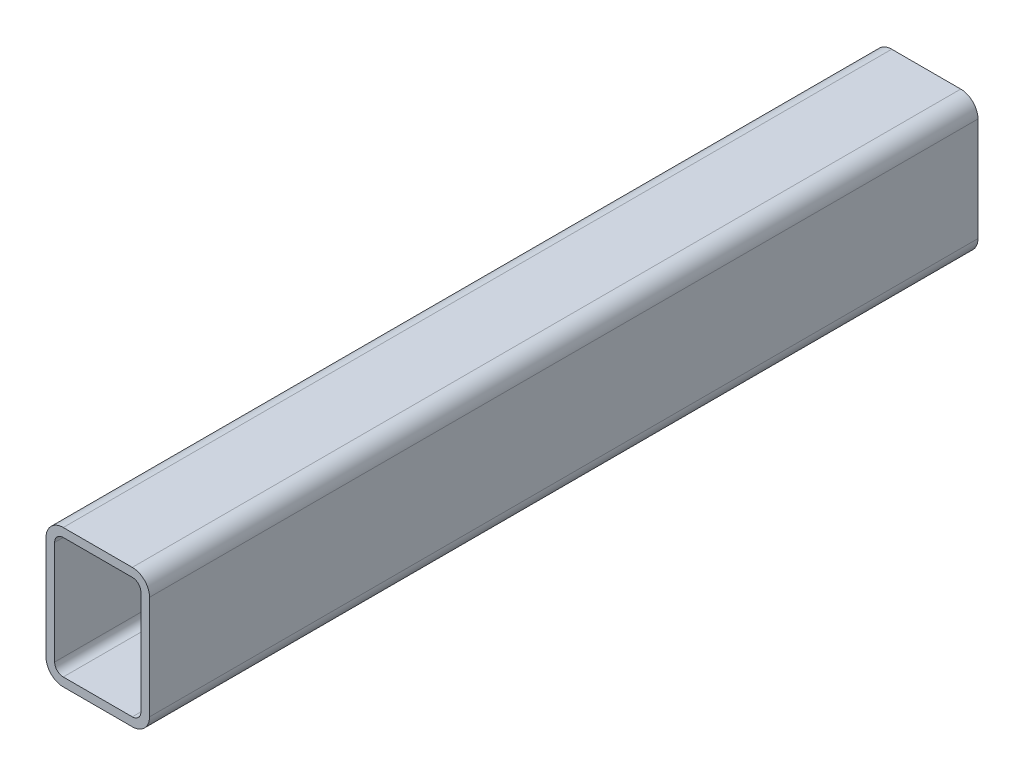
from build123d import *

# Parameters (mm, degrees)
BOSS_EXTRUDE1_DEPTH = 304.8


with BuildPart() as part:
    # Sketch1 → Boss-Extrude1 (new body)
    with BuildSketch(Plane.XY):
        with BuildLine():
            Line((6.35, 50.8), (31.75, 50.8))
            ThreePointArc((31.75, 50.8), (36.240128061, 48.940128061), (38.1, 44.45))
            Line((38.1, 44.45), (38.1, 6.35))
            ThreePointArc((38.1, 6.35), (36.240128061, 1.859871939), (31.75, 0))
            Line((31.75, 0), (6.35, 0))
            ThreePointArc((6.35, 0), (1.859871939, 1.859871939), (0, 6.35))
            Line((0, 6.35), (0, 44.45))
            ThreePointArc((0, 44.45), (1.859871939, 48.940128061), (6.35, 50.8))
        make_face()
        with BuildLine():
            Line((6.35, 47.625), (31.75, 47.625))
            ThreePointArc((31.75, 47.625), (33.99506403, 46.69506403), (34.925, 44.45))
            Line((34.925, 44.45), (34.925, 6.35))
            ThreePointArc((34.925, 6.35), (33.99506403, 4.10493597), (31.75, 3.175))
            Line((31.75, 3.175), (6.35, 3.175))
            ThreePointArc((6.35, 3.175), (4.10493597, 4.10493597), (3.175, 6.35))
            Line((3.175, 6.35), (3.175, 44.45))
            ThreePointArc((3.175, 44.45), (4.10493597, 46.69506403), (6.35, 47.625))
        make_face(mode=Mode.SUBTRACT)
    extrude(amount=BOSS_EXTRUDE1_DEPTH)


solid = part.part
